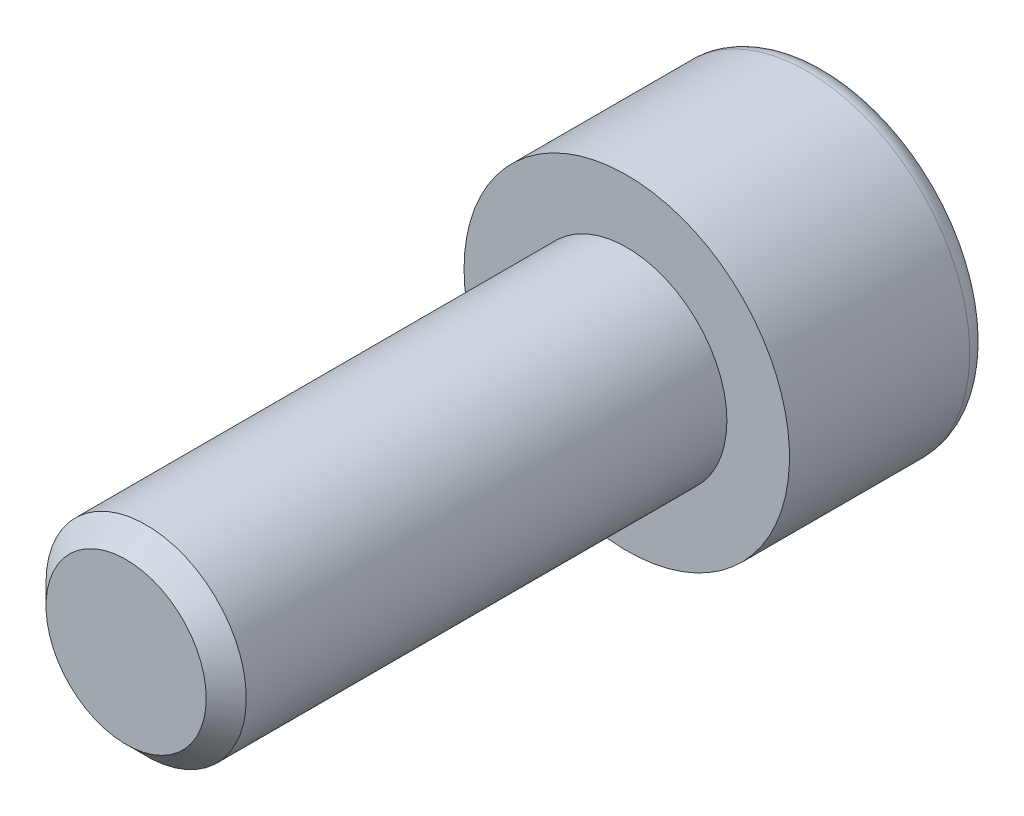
ISO-10303-21;
HEADER;
FILE_DESCRIPTION(('STEP AP214'),'2;1');
FILE_NAME('part.step','',(''),(''),'','','');
FILE_SCHEMA(('AUTOMOTIVE_DESIGN { 1 0 10303 214 1 1 1 1 }'));
ENDSEC;
DATA;
#1=APPLICATION_CONTEXT('core data for automotive mechanical design processes');
#2=APPLICATION_PROTOCOL_DEFINITION('international standard','automotive_design',2000,#1);
#3=PRODUCT_CONTEXT('',#1,'mechanical');
#4=PRODUCT('Part','Part','',(#3));
#5=PRODUCT_RELATED_PRODUCT_CATEGORY('part','',(#4));
#6=PRODUCT_DEFINITION_FORMATION('','',#4);
#7=PRODUCT_DEFINITION_CONTEXT('part definition',#1,'design');
#8=PRODUCT_DEFINITION('design','',#6,#7);
#9=PRODUCT_DEFINITION_SHAPE('','',#8);
#10=(LENGTH_UNIT() NAMED_UNIT(*) SI_UNIT(.MILLI.,.METRE.));
#11=(NAMED_UNIT(*) PLANE_ANGLE_UNIT() SI_UNIT($,.RADIAN.));
#12=(NAMED_UNIT(*) SI_UNIT($,.STERADIAN.) SOLID_ANGLE_UNIT());
#13=UNCERTAINTY_MEASURE_WITH_UNIT(LENGTH_MEASURE(1.E-05),#10,'distance_accuracy_value','');
#14=(GEOMETRIC_REPRESENTATION_CONTEXT(3) GLOBAL_UNCERTAINTY_ASSIGNED_CONTEXT((#13)) GLOBAL_UNIT_ASSIGNED_CONTEXT((#10,
#11,#12)) REPRESENTATION_CONTEXT('',''));
#15=CARTESIAN_POINT('',(0.,0.,0.));
#16=DIRECTION('',(0.,0.,1.));
#17=DIRECTION('',(1.,0.,0.));
#18=AXIS2_PLACEMENT_3D('',#15,#16,#17);
#19=CARTESIAN_POINT('',(0.,0.,-8.));
#20=DIRECTION('',(0.,0.,1.));
#21=DIRECTION('',(1.,0.,0.));
#22=AXIS2_PLACEMENT_3D('',#19,#20,#21);
#23=PLANE('',#22);
#24=CARTESIAN_POINT('',(0.,0.,-8.));
#25=DIRECTION('',(0.,0.,-1.));
#26=DIRECTION('',(-1.,0.,0.));
#27=AXIS2_PLACEMENT_3D('',#24,#25,#26);
#28=CIRCLE('',#27,5.7);
#29=CARTESIAN_POINT('',(-5.7,0.,-8.));
#30=VERTEX_POINT('',#29);
#31=EDGE_CURVE('E458',#30,#30,#28,.T.);
#32=ORIENTED_EDGE('',*,*,#31,.T.);
#33=EDGE_LOOP('',(#32));
#34=FACE_BOUND('',#33,.T.);
#35=DIRECTION('',(-0.86602540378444,0.499999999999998,0.));
#36=VECTOR('',#35,1.);
#37=CARTESIAN_POINT('',(0.,3.46410161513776,-8.));
#38=LINE('',#37,#36);
#39=CARTESIAN_POINT('',(3.,1.73205080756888,-8.));
#40=VERTEX_POINT('',#39);
#41=CARTESIAN_POINT('',(0.,3.46410161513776,-8.));
#42=VERTEX_POINT('',#41);
#43=EDGE_CURVE('E362',#40,#42,#38,.T.);
#44=ORIENTED_EDGE('',*,*,#43,.T.);
#45=DIRECTION('',(-0.866025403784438,-0.500000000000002,0.));
#46=VECTOR('',#45,1.);
#47=CARTESIAN_POINT('',(0.,3.46410161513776,-8.));
#48=LINE('',#47,#46);
#49=CARTESIAN_POINT('',(-3.,1.73205080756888,-8.));
#50=VERTEX_POINT('',#49);
#51=EDGE_CURVE('E402',#42,#50,#48,.T.);
#52=ORIENTED_EDGE('',*,*,#51,.T.);
#53=DIRECTION('',(0.,-1.,0.));
#54=VECTOR('',#53,1.);
#55=CARTESIAN_POINT('',(-3.,-1.73205080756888,-8.));
#56=LINE('',#55,#54);
#57=CARTESIAN_POINT('',(-3.,-1.73205080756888,-8.));
#58=VERTEX_POINT('',#57);
#59=EDGE_CURVE('E410',#50,#58,#56,.T.);
#60=ORIENTED_EDGE('',*,*,#59,.T.);
#61=DIRECTION('',(0.866025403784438,-0.500000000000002,0.));
#62=VECTOR('',#61,1.);
#63=CARTESIAN_POINT('',(0.,-3.46410161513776,-8.));
#64=LINE('',#63,#62);
#65=CARTESIAN_POINT('',(0.,-3.46410161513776,-8.));
#66=VERTEX_POINT('',#65);
#67=EDGE_CURVE('E428',#58,#66,#64,.T.);
#68=ORIENTED_EDGE('',*,*,#67,.T.);
#69=DIRECTION('',(0.86602540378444,0.499999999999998,0.));
#70=VECTOR('',#69,1.);
#71=CARTESIAN_POINT('',(0.,-3.46410161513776,-8.));
#72=LINE('',#71,#70);
#73=CARTESIAN_POINT('',(3.,-1.73205080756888,-8.));
#74=VERTEX_POINT('',#73);
#75=EDGE_CURVE('E431',#66,#74,#72,.T.);
#76=ORIENTED_EDGE('',*,*,#75,.T.);
#77=DIRECTION('',(0.,1.,0.));
#78=VECTOR('',#77,1.);
#79=CARTESIAN_POINT('',(3.,-1.73205080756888,-8.));
#80=LINE('',#79,#78);
#81=EDGE_CURVE('E421',#74,#40,#80,.T.);
#82=ORIENTED_EDGE('',*,*,#81,.T.);
#83=EDGE_LOOP('',(#44,#52,#60,#68,#76,#82));
#84=FACE_BOUND('',#83,.T.);
#85=ADVANCED_FACE('F348',(#34,#84),#23,.F.);
#86=CARTESIAN_POINT('',(0.,0.,-7.2));
#87=DIRECTION('',(0.,0.,-1.));
#88=DIRECTION('',(-1.,0.,0.));
#89=AXIS2_PLACEMENT_3D('',#86,#87,#88);
#90=TOROIDAL_SURFACE('',#89,5.7,0.8);
#91=ORIENTED_EDGE('',*,*,#31,.F.);
#92=EDGE_LOOP('',(#91));
#93=FACE_BOUND('',#92,.T.);
#94=CARTESIAN_POINT('',(0.,0.,-7.2));
#95=DIRECTION('',(0.,0.,-1.));
#96=DIRECTION('',(-1.,0.,0.));
#97=AXIS2_PLACEMENT_3D('',#94,#95,#96);
#98=CIRCLE('',#97,6.5);
#99=CARTESIAN_POINT('',(-6.5,0.,-7.2));
#100=VERTEX_POINT('',#99);
#101=EDGE_CURVE('E455',#100,#100,#98,.T.);
#102=ORIENTED_EDGE('',*,*,#101,.T.);
#103=EDGE_LOOP('',(#102));
#104=FACE_BOUND('',#103,.T.);
#105=ADVANCED_FACE('F477',(#93,#104),#90,.T.);
#106=CARTESIAN_POINT('',(0.,0.,0.));
#107=DIRECTION('',(0.,0.,-1.));
#108=DIRECTION('',(-1.,0.,0.));
#109=AXIS2_PLACEMENT_3D('',#106,#107,#108);
#110=CYLINDRICAL_SURFACE('',#109,6.5);
#111=ORIENTED_EDGE('',*,*,#101,.F.);
#112=EDGE_LOOP('',(#111));
#113=FACE_BOUND('',#112,.T.);
#114=CARTESIAN_POINT('',(0.,0.,0.));
#115=DIRECTION('',(0.,0.,-1.));
#116=DIRECTION('',(-1.,0.,0.));
#117=AXIS2_PLACEMENT_3D('',#114,#115,#116);
#118=CIRCLE('',#117,6.5);
#119=CARTESIAN_POINT('',(-6.5,0.,0.));
#120=VERTEX_POINT('',#119);
#121=EDGE_CURVE('E416',#120,#120,#118,.T.);
#122=ORIENTED_EDGE('',*,*,#121,.T.);
#123=EDGE_LOOP('',(#122));
#124=FACE_BOUND('',#123,.T.);
#125=ADVANCED_FACE('F482',(#113,#124),#110,.T.);
#126=CARTESIAN_POINT('',(0.,0.,0.));
#127=DIRECTION('',(0.,0.,-1.));
#128=DIRECTION('',(-1.,0.,0.));
#129=AXIS2_PLACEMENT_3D('',#126,#127,#128);
#130=PLANE('',#129);
#131=CARTESIAN_POINT('',(0.,0.,0.));
#132=DIRECTION('',(0.,0.,1.));
#133=DIRECTION('',(1.,0.,0.));
#134=AXIS2_PLACEMENT_3D('',#131,#132,#133);
#135=CIRCLE('',#134,4.);
#136=CARTESIAN_POINT('',(4.,0.,0.));
#137=VERTEX_POINT('',#136);
#138=EDGE_CURVE('E422',#137,#137,#135,.T.);
#139=ORIENTED_EDGE('',*,*,#138,.F.);
#140=EDGE_LOOP('',(#139));
#141=FACE_BOUND('',#140,.T.);
#142=ORIENTED_EDGE('',*,*,#121,.F.);
#143=EDGE_LOOP('',(#142));
#144=FACE_BOUND('',#143,.T.);
#145=ADVANCED_FACE('F490',(#141,#144),#130,.F.);
#146=CARTESIAN_POINT('',(0.,3.46410161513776,-3.7));
#147=DIRECTION('',(-0.499999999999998,-0.86602540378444,0.));
#148=DIRECTION('',(0.86602540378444,-0.499999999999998,0.));
#149=AXIS2_PLACEMENT_3D('',#146,#147,#148);
#150=PLANE('',#149);
#151=ORIENTED_EDGE('',*,*,#43,.F.);
#152=DIRECTION('',(0.,0.,-1.));
#153=VECTOR('',#152,1.);
#154=CARTESIAN_POINT('',(3.,1.73205080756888,-3.7));
#155=LINE('',#154,#153);
#156=CARTESIAN_POINT('',(3.,1.73205080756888,-3.7));
#157=VERTEX_POINT('',#156);
#158=EDGE_CURVE('E444',#157,#40,#155,.T.);
#159=ORIENTED_EDGE('',*,*,#158,.F.);
#160=DIRECTION('',(-0.86602540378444,0.499999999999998,0.));
#161=VECTOR('',#160,1.);
#162=CARTESIAN_POINT('',(0.,3.46410161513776,-3.7));
#163=LINE('',#162,#161);
#164=CARTESIAN_POINT('',(0.,3.46410161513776,-3.7));
#165=VERTEX_POINT('',#164);
#166=EDGE_CURVE('E415',#157,#165,#163,.T.);
#167=ORIENTED_EDGE('',*,*,#166,.T.);
#168=DIRECTION('',(0.,0.,-1.));
#169=VECTOR('',#168,1.);
#170=CARTESIAN_POINT('',(0.,3.46410161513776,-3.7));
#171=LINE('',#170,#169);
#172=EDGE_CURVE('E404',#165,#42,#171,.T.);
#173=ORIENTED_EDGE('',*,*,#172,.T.);
#174=EDGE_LOOP('',(#151,#159,#167,#173));
#175=FACE_BOUND('',#174,.T.);
#176=ADVANCED_FACE('F413',(#175),#150,.T.);
#177=CARTESIAN_POINT('',(0.,3.46410161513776,-3.7));
#178=DIRECTION('',(0.500000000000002,-0.866025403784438,0.));
#179=DIRECTION('',(0.866025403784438,0.500000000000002,0.));
#180=AXIS2_PLACEMENT_3D('',#177,#178,#179);
#181=PLANE('',#180);
#182=ORIENTED_EDGE('',*,*,#51,.F.);
#183=ORIENTED_EDGE('',*,*,#172,.F.);
#184=DIRECTION('',(-0.866025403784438,-0.500000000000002,0.));
#185=VECTOR('',#184,1.);
#186=CARTESIAN_POINT('',(0.,3.46410161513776,-3.7));
#187=LINE('',#186,#185);
#188=CARTESIAN_POINT('',(-3.,1.73205080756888,-3.7));
#189=VERTEX_POINT('',#188);
#190=EDGE_CURVE('E435',#165,#189,#187,.T.);
#191=ORIENTED_EDGE('',*,*,#190,.T.);
#192=DIRECTION('',(0.,0.,-1.));
#193=VECTOR('',#192,1.);
#194=CARTESIAN_POINT('',(-3.,1.73205080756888,-3.7));
#195=LINE('',#194,#193);
#196=EDGE_CURVE('E406',#189,#50,#195,.T.);
#197=ORIENTED_EDGE('',*,*,#196,.T.);
#198=EDGE_LOOP('',(#182,#183,#191,#197));
#199=FACE_BOUND('',#198,.T.);
#200=ADVANCED_FACE('F403',(#199),#181,.T.);
#201=CARTESIAN_POINT('',(-3.,-1.73205080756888,-3.7));
#202=DIRECTION('',(1.,0.,0.));
#203=DIRECTION('',(0.,0.,-1.));
#204=AXIS2_PLACEMENT_3D('',#201,#202,#203);
#205=PLANE('',#204);
#206=ORIENTED_EDGE('',*,*,#59,.F.);
#207=ORIENTED_EDGE('',*,*,#196,.F.);
#208=DIRECTION('',(0.,-1.,0.));
#209=VECTOR('',#208,1.);
#210=CARTESIAN_POINT('',(-3.,-1.73205080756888,-3.7));
#211=LINE('',#210,#209);
#212=CARTESIAN_POINT('',(-3.,-1.73205080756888,-3.7));
#213=VERTEX_POINT('',#212);
#214=EDGE_CURVE('E437',#189,#213,#211,.T.);
#215=ORIENTED_EDGE('',*,*,#214,.T.);
#216=DIRECTION('',(0.,0.,-1.));
#217=VECTOR('',#216,1.);
#218=CARTESIAN_POINT('',(-3.,-1.73205080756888,-3.7));
#219=LINE('',#218,#217);
#220=EDGE_CURVE('E450',#213,#58,#219,.T.);
#221=ORIENTED_EDGE('',*,*,#220,.T.);
#222=EDGE_LOOP('',(#206,#207,#215,#221));
#223=FACE_BOUND('',#222,.T.);
#224=ADVANCED_FACE('F505',(#223),#205,.T.);
#225=CARTESIAN_POINT('',(0.,-3.46410161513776,-3.7));
#226=DIRECTION('',(0.500000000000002,0.866025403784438,0.));
#227=DIRECTION('',(-0.866025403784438,0.500000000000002,0.));
#228=AXIS2_PLACEMENT_3D('',#225,#226,#227);
#229=PLANE('',#228);
#230=ORIENTED_EDGE('',*,*,#67,.F.);
#231=ORIENTED_EDGE('',*,*,#220,.F.);
#232=DIRECTION('',(0.866025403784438,-0.500000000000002,0.));
#233=VECTOR('',#232,1.);
#234=CARTESIAN_POINT('',(0.,-3.46410161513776,-3.7));
#235=LINE('',#234,#233);
#236=CARTESIAN_POINT('',(0.,-3.46410161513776,-3.7));
#237=VERTEX_POINT('',#236);
#238=EDGE_CURVE('E439',#213,#237,#235,.T.);
#239=ORIENTED_EDGE('',*,*,#238,.T.);
#240=DIRECTION('',(0.,0.,-1.));
#241=VECTOR('',#240,1.);
#242=CARTESIAN_POINT('',(0.,-3.46410161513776,-3.7));
#243=LINE('',#242,#241);
#244=EDGE_CURVE('E448',#237,#66,#243,.T.);
#245=ORIENTED_EDGE('',*,*,#244,.T.);
#246=EDGE_LOOP('',(#230,#231,#239,#245));
#247=FACE_BOUND('',#246,.T.);
#248=ADVANCED_FACE('F508',(#247),#229,.T.);
#249=CARTESIAN_POINT('',(0.,-3.46410161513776,-3.7));
#250=DIRECTION('',(-0.499999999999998,0.86602540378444,0.));
#251=DIRECTION('',(-0.86602540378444,-0.499999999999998,0.));
#252=AXIS2_PLACEMENT_3D('',#249,#250,#251);
#253=PLANE('',#252);
#254=ORIENTED_EDGE('',*,*,#75,.F.);
#255=ORIENTED_EDGE('',*,*,#244,.F.);
#256=DIRECTION('',(0.86602540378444,0.499999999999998,0.));
#257=VECTOR('',#256,1.);
#258=CARTESIAN_POINT('',(0.,-3.46410161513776,-3.7));
#259=LINE('',#258,#257);
#260=CARTESIAN_POINT('',(3.,-1.73205080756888,-3.7));
#261=VERTEX_POINT('',#260);
#262=EDGE_CURVE('E441',#237,#261,#259,.T.);
#263=ORIENTED_EDGE('',*,*,#262,.T.);
#264=DIRECTION('',(0.,0.,-1.));
#265=VECTOR('',#264,1.);
#266=CARTESIAN_POINT('',(3.,-1.73205080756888,-3.7));
#267=LINE('',#266,#265);
#268=EDGE_CURVE('E446',#261,#74,#267,.T.);
#269=ORIENTED_EDGE('',*,*,#268,.T.);
#270=EDGE_LOOP('',(#254,#255,#263,#269));
#271=FACE_BOUND('',#270,.T.);
#272=ADVANCED_FACE('F512',(#271),#253,.T.);
#273=CARTESIAN_POINT('',(3.,-1.73205080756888,-3.7));
#274=DIRECTION('',(-1.,0.,0.));
#275=DIRECTION('',(0.,0.,1.));
#276=AXIS2_PLACEMENT_3D('',#273,#274,#275);
#277=PLANE('',#276);
#278=ORIENTED_EDGE('',*,*,#81,.F.);
#279=ORIENTED_EDGE('',*,*,#268,.F.);
#280=DIRECTION('',(0.,1.,0.));
#281=VECTOR('',#280,1.);
#282=CARTESIAN_POINT('',(3.,-1.73205080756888,-3.7));
#283=LINE('',#282,#281);
#284=EDGE_CURVE('E369',#261,#157,#283,.T.);
#285=ORIENTED_EDGE('',*,*,#284,.T.);
#286=ORIENTED_EDGE('',*,*,#158,.T.);
#287=EDGE_LOOP('',(#278,#279,#285,#286));
#288=FACE_BOUND('',#287,.T.);
#289=ADVANCED_FACE('F516',(#288),#277,.T.);
#290=CARTESIAN_POINT('',(3.,1.73205080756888,-3.7));
#291=DIRECTION('',(0.,0.,1.));
#292=DIRECTION('',(1.,0.,0.));
#293=AXIS2_PLACEMENT_3D('',#290,#291,#292);
#294=PLANE('',#293);
#295=ORIENTED_EDGE('',*,*,#166,.F.);
#296=ORIENTED_EDGE('',*,*,#284,.F.);
#297=ORIENTED_EDGE('',*,*,#262,.F.);
#298=ORIENTED_EDGE('',*,*,#238,.F.);
#299=ORIENTED_EDGE('',*,*,#214,.F.);
#300=ORIENTED_EDGE('',*,*,#190,.F.);
#301=EDGE_LOOP('',(#295,#296,#297,#298,#299,#300));
#302=FACE_BOUND('',#301,.T.);
#303=ADVANCED_FACE('F520',(#302),#294,.F.);
#304=CARTESIAN_POINT('',(0.,0.,20.));
#305=DIRECTION('',(0.,0.,1.));
#306=DIRECTION('',(1.,0.,0.));
#307=AXIS2_PLACEMENT_3D('',#304,#305,#306);
#308=PLANE('',#307);
#309=CARTESIAN_POINT('',(0.,0.,20.));
#310=DIRECTION('',(0.,0.,1.));
#311=DIRECTION('',(1.,0.,0.));
#312=AXIS2_PLACEMENT_3D('',#309,#310,#311);
#313=CIRCLE('',#312,3.19999999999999);
#314=CARTESIAN_POINT('',(3.19999999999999,0.,20.));
#315=VERTEX_POINT('',#314);
#316=EDGE_CURVE('E355',#315,#315,#313,.T.);
#317=ORIENTED_EDGE('',*,*,#316,.T.);
#318=EDGE_LOOP('',(#317));
#319=FACE_BOUND('',#318,.T.);
#320=ADVANCED_FACE('F463',(#319),#308,.T.);
#321=CARTESIAN_POINT('',(0.,0.,0.));
#322=DIRECTION('',(0.,0.,1.));
#323=DIRECTION('',(1.,0.,0.));
#324=AXIS2_PLACEMENT_3D('',#321,#322,#323);
#325=CYLINDRICAL_SURFACE('',#324,4.);
#326=CARTESIAN_POINT('',(0.,0.,19.2));
#327=DIRECTION('',(0.,0.,1.));
#328=DIRECTION('',(1.,0.,0.));
#329=AXIS2_PLACEMENT_3D('',#326,#327,#328);
#330=CIRCLE('',#329,4.);
#331=CARTESIAN_POINT('',(4.,0.,19.2));
#332=VERTEX_POINT('',#331);
#333=EDGE_CURVE('E11',#332,#332,#330,.F.);
#334=ORIENTED_EDGE('',*,*,#333,.T.);
#335=EDGE_LOOP('',(#334));
#336=FACE_BOUND('',#335,.T.);
#337=ORIENTED_EDGE('',*,*,#138,.T.);
#338=EDGE_LOOP('',(#337));
#339=FACE_BOUND('',#338,.T.);
#340=ADVANCED_FACE('F467',(#336,#339),#325,.T.);
#341=CARTESIAN_POINT('',(0.,0.,20.));
#342=DIRECTION('',(0.,0.,-1.));
#343=DIRECTION('',(-1.,0.,0.));
#344=AXIS2_PLACEMENT_3D('',#341,#342,#343);
#345=CONICAL_SURFACE('',#344,3.19999999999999,0.785398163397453);
#346=ORIENTED_EDGE('',*,*,#333,.F.);
#347=EDGE_LOOP('',(#346));
#348=FACE_BOUND('',#347,.T.);
#349=ORIENTED_EDGE('',*,*,#316,.F.);
#350=EDGE_LOOP('',(#349));
#351=FACE_BOUND('',#350,.T.);
#352=ADVANCED_FACE('F465',(#348,#351),#345,.T.);
#353=CLOSED_SHELL('',(#85,#105,#125,#145,#176,#200,#224,#248,#272,#289,#303,#320,#340,#352));
#354=MANIFOLD_SOLID_BREP('B2',#353);
#355=ADVANCED_BREP_SHAPE_REPRESENTATION('',(#18,#354),#14);
#356=SHAPE_DEFINITION_REPRESENTATION(#9,#355);
ENDSEC;
END-ISO-10303-21;
